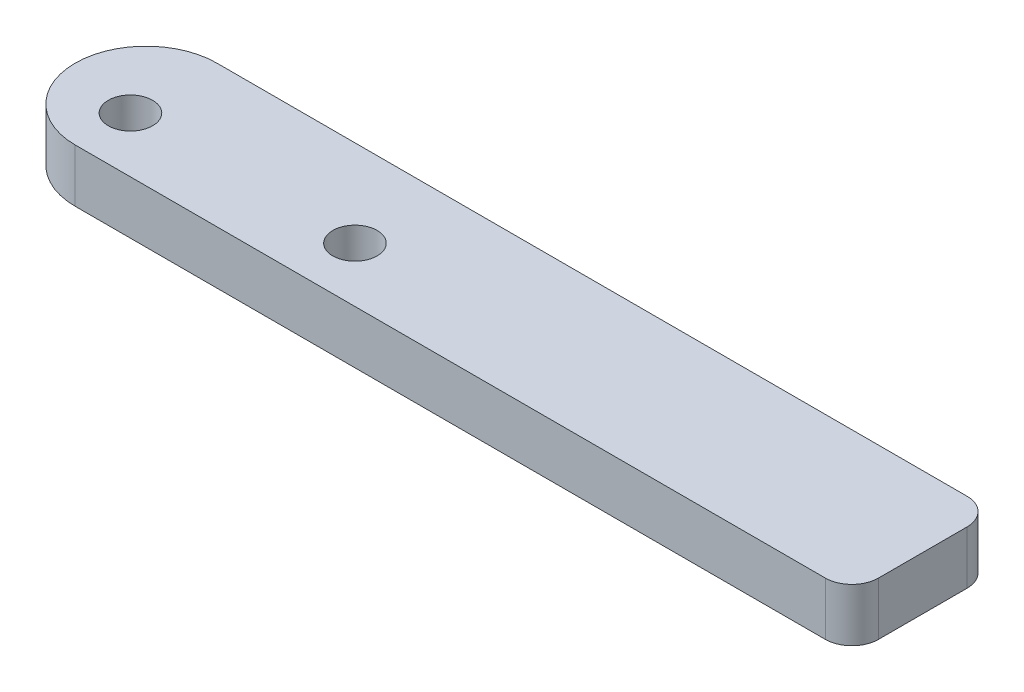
ISO-10303-21;
HEADER;
FILE_DESCRIPTION(('STEP AP214'),'2;1');
FILE_NAME('part.step','',(''),(''),'','','');
FILE_SCHEMA(('AUTOMOTIVE_DESIGN { 1 0 10303 214 1 1 1 1 }'));
ENDSEC;
DATA;
#1=APPLICATION_CONTEXT('core data for automotive mechanical design processes');
#2=APPLICATION_PROTOCOL_DEFINITION('international standard','automotive_design',2000,#1);
#3=PRODUCT_CONTEXT('',#1,'mechanical');
#4=PRODUCT('Part','Part','',(#3));
#5=PRODUCT_RELATED_PRODUCT_CATEGORY('part','',(#4));
#6=PRODUCT_DEFINITION_FORMATION('','',#4);
#7=PRODUCT_DEFINITION_CONTEXT('part definition',#1,'design');
#8=PRODUCT_DEFINITION('design','',#6,#7);
#9=PRODUCT_DEFINITION_SHAPE('','',#8);
#10=(LENGTH_UNIT() NAMED_UNIT(*) SI_UNIT(.MILLI.,.METRE.));
#11=(NAMED_UNIT(*) PLANE_ANGLE_UNIT() SI_UNIT($,.RADIAN.));
#12=(NAMED_UNIT(*) SI_UNIT($,.STERADIAN.) SOLID_ANGLE_UNIT());
#13=UNCERTAINTY_MEASURE_WITH_UNIT(LENGTH_MEASURE(1.E-05),#10,'distance_accuracy_value','');
#14=(GEOMETRIC_REPRESENTATION_CONTEXT(3) GLOBAL_UNCERTAINTY_ASSIGNED_CONTEXT((#13)) GLOBAL_UNIT_ASSIGNED_CONTEXT((#10,
#11,#12)) REPRESENTATION_CONTEXT('',''));
#15=CARTESIAN_POINT('',(0.,0.,0.));
#16=DIRECTION('',(0.,0.,1.));
#17=DIRECTION('',(1.,0.,0.));
#18=AXIS2_PLACEMENT_3D('',#15,#16,#17);
#19=CARTESIAN_POINT('',(0.,-3.00000000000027,-1.76));
#20=DIRECTION('',(0.,1.,0.));
#21=DIRECTION('',(-1.,0.,0.));
#22=AXIS2_PLACEMENT_3D('',#19,#20,#21);
#23=CYLINDRICAL_SURFACE('',#22,8.);
#24=DIRECTION('',(0.,1.,0.));
#25=VECTOR('',#24,1.);
#26=CARTESIAN_POINT('',(0.,-3.00000000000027,6.24));
#27=LINE('',#26,#25);
#28=CARTESIAN_POINT('',(0.,-3.00000000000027,6.24));
#29=VERTEX_POINT('',#28);
#30=CARTESIAN_POINT('',(0.,2.99999999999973,6.24));
#31=VERTEX_POINT('',#30);
#32=EDGE_CURVE('E140',#29,#31,#27,.T.);
#33=ORIENTED_EDGE('',*,*,#32,.T.);
#34=CARTESIAN_POINT('',(0.,2.99999999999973,-1.76));
#35=DIRECTION('',(0.,-1.,0.));
#36=DIRECTION('',(1.,0.,0.));
#37=AXIS2_PLACEMENT_3D('',#34,#35,#36);
#38=CIRCLE('',#37,8.);
#39=CARTESIAN_POINT('',(0.,2.99999999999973,-9.76));
#40=VERTEX_POINT('',#39);
#41=EDGE_CURVE('E9',#31,#40,#38,.T.);
#42=ORIENTED_EDGE('',*,*,#41,.T.);
#43=DIRECTION('',(0.,1.,0.));
#44=VECTOR('',#43,1.);
#45=CARTESIAN_POINT('',(0.,-3.00000000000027,-9.76));
#46=LINE('',#45,#44);
#47=CARTESIAN_POINT('',(0.,-3.00000000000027,-9.76));
#48=VERTEX_POINT('',#47);
#49=EDGE_CURVE('E39',#48,#40,#46,.T.);
#50=ORIENTED_EDGE('',*,*,#49,.F.);
#51=CARTESIAN_POINT('',(0.,-3.00000000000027,-1.76));
#52=DIRECTION('',(0.,-1.,0.));
#53=DIRECTION('',(1.,0.,0.));
#54=AXIS2_PLACEMENT_3D('',#51,#52,#53);
#55=CIRCLE('',#54,8.);
#56=EDGE_CURVE('E133',#29,#48,#55,.T.);
#57=ORIENTED_EDGE('',*,*,#56,.F.);
#58=EDGE_LOOP('',(#33,#42,#50,#57));
#59=FACE_BOUND('',#58,.T.);
#60=ADVANCED_FACE('F14',(#59),#23,.T.);
#61=CARTESIAN_POINT('',(0.,-3.00000000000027,6.24));
#62=DIRECTION('',(0.,0.,-1.));
#63=DIRECTION('',(0.,1.,0.));
#64=AXIS2_PLACEMENT_3D('',#61,#62,#63);
#65=PLANE('',#64);
#66=DIRECTION('',(-1.,0.,0.));
#67=VECTOR('',#66,1.);
#68=CARTESIAN_POINT('',(0.,-3.00000000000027,6.24));
#69=LINE('',#68,#67);
#70=CARTESIAN_POINT('',(84.69,-3.00000000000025,6.24));
#71=VERTEX_POINT('',#70);
#72=EDGE_CURVE('E110',#71,#29,#69,.T.);
#73=ORIENTED_EDGE('',*,*,#72,.F.);
#74=DIRECTION('',(0.,1.,0.));
#75=VECTOR('',#74,1.);
#76=CARTESIAN_POINT('',(84.69,-3.00000000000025,6.24));
#77=LINE('',#76,#75);
#78=CARTESIAN_POINT('',(84.69,2.99999999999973,6.24));
#79=VERTEX_POINT('',#78);
#80=EDGE_CURVE('E105',#71,#79,#77,.T.);
#81=ORIENTED_EDGE('',*,*,#80,.T.);
#82=DIRECTION('',(-1.,0.,0.));
#83=VECTOR('',#82,1.);
#84=CARTESIAN_POINT('',(0.,2.99999999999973,6.24));
#85=LINE('',#84,#83);
#86=EDGE_CURVE('E83',#79,#31,#85,.T.);
#87=ORIENTED_EDGE('',*,*,#86,.T.);
#88=ORIENTED_EDGE('',*,*,#32,.F.);
#89=EDGE_LOOP('',(#73,#81,#87,#88));
#90=FACE_BOUND('',#89,.T.);
#91=ADVANCED_FACE('F16',(#90),#65,.F.);
#92=CARTESIAN_POINT('',(84.69,-3.00000000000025,3.24));
#93=DIRECTION('',(0.,1.,0.));
#94=DIRECTION('',(-1.,0.,0.));
#95=AXIS2_PLACEMENT_3D('',#92,#93,#94);
#96=CYLINDRICAL_SURFACE('',#95,3.);
#97=CARTESIAN_POINT('',(84.69,-3.00000000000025,3.24));
#98=DIRECTION('',(0.,-1.,0.));
#99=DIRECTION('',(1.,0.,0.));
#100=AXIS2_PLACEMENT_3D('',#97,#98,#99);
#101=CIRCLE('',#100,3.);
#102=CARTESIAN_POINT('',(87.69,-3.00000000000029,3.24));
#103=VERTEX_POINT('',#102);
#104=EDGE_CURVE('E100',#103,#71,#101,.T.);
#105=ORIENTED_EDGE('',*,*,#104,.F.);
#106=DIRECTION('',(0.,-1.,0.));
#107=VECTOR('',#106,1.);
#108=CARTESIAN_POINT('',(87.69,-3.00000000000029,3.24));
#109=LINE('',#108,#107);
#110=CARTESIAN_POINT('',(87.69,2.99999999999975,3.24));
#111=VERTEX_POINT('',#110);
#112=EDGE_CURVE('E103',#111,#103,#109,.T.);
#113=ORIENTED_EDGE('',*,*,#112,.F.);
#114=CARTESIAN_POINT('',(84.69,2.99999999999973,3.24));
#115=DIRECTION('',(0.,1.,0.));
#116=DIRECTION('',(1.,0.,0.));
#117=AXIS2_PLACEMENT_3D('',#114,#115,#116);
#118=CIRCLE('',#117,3.);
#119=EDGE_CURVE('E141',#79,#111,#118,.T.);
#120=ORIENTED_EDGE('',*,*,#119,.F.);
#121=ORIENTED_EDGE('',*,*,#80,.F.);
#122=EDGE_LOOP('',(#105,#113,#120,#121));
#123=FACE_BOUND('',#122,.T.);
#124=ADVANCED_FACE('F102',(#123),#96,.T.);
#125=CARTESIAN_POINT('',(87.69,-3.00000000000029,6.24));
#126=DIRECTION('',(-1.,0.,0.));
#127=DIRECTION('',(0.,0.,1.));
#128=AXIS2_PLACEMENT_3D('',#125,#126,#127);
#129=PLANE('',#128);
#130=DIRECTION('',(0.,0.,1.));
#131=VECTOR('',#130,1.);
#132=CARTESIAN_POINT('',(87.69,-3.00000000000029,6.24));
#133=LINE('',#132,#131);
#134=CARTESIAN_POINT('',(87.69,-3.00000000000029,-6.76));
#135=VERTEX_POINT('',#134);
#136=EDGE_CURVE('E109',#135,#103,#133,.T.);
#137=ORIENTED_EDGE('',*,*,#136,.F.);
#138=DIRECTION('',(0.,1.,0.));
#139=VECTOR('',#138,1.);
#140=CARTESIAN_POINT('',(87.69,-3.00000000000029,-6.76));
#141=LINE('',#140,#139);
#142=CARTESIAN_POINT('',(87.69,2.99999999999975,-6.76));
#143=VERTEX_POINT('',#142);
#144=EDGE_CURVE('E126',#135,#143,#141,.T.);
#145=ORIENTED_EDGE('',*,*,#144,.T.);
#146=DIRECTION('',(0.,0.,1.));
#147=VECTOR('',#146,1.);
#148=CARTESIAN_POINT('',(87.69,2.99999999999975,6.24));
#149=LINE('',#148,#147);
#150=EDGE_CURVE('E18',#143,#111,#149,.T.);
#151=ORIENTED_EDGE('',*,*,#150,.T.);
#152=ORIENTED_EDGE('',*,*,#112,.T.);
#153=EDGE_LOOP('',(#137,#145,#151,#152));
#154=FACE_BOUND('',#153,.T.);
#155=ADVANCED_FACE('F120',(#154),#129,.F.);
#156=CARTESIAN_POINT('',(84.69,-3.00000000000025,-6.76));
#157=DIRECTION('',(0.,1.,0.));
#158=DIRECTION('',(-1.,0.,0.));
#159=AXIS2_PLACEMENT_3D('',#156,#157,#158);
#160=CYLINDRICAL_SURFACE('',#159,3.);
#161=CARTESIAN_POINT('',(84.69,-3.00000000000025,-6.76));
#162=DIRECTION('',(0.,-1.,0.));
#163=DIRECTION('',(1.,0.,0.));
#164=AXIS2_PLACEMENT_3D('',#161,#162,#163);
#165=CIRCLE('',#164,3.);
#166=CARTESIAN_POINT('',(84.69,-3.00000000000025,-9.76));
#167=VERTEX_POINT('',#166);
#168=EDGE_CURVE('E116',#167,#135,#165,.T.);
#169=ORIENTED_EDGE('',*,*,#168,.F.);
#170=DIRECTION('',(0.,-1.,0.));
#171=VECTOR('',#170,1.);
#172=CARTESIAN_POINT('',(84.69,-3.00000000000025,-9.76));
#173=LINE('',#172,#171);
#174=CARTESIAN_POINT('',(84.69,2.99999999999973,-9.76));
#175=VERTEX_POINT('',#174);
#176=EDGE_CURVE('E135',#175,#167,#173,.T.);
#177=ORIENTED_EDGE('',*,*,#176,.F.);
#178=CARTESIAN_POINT('',(84.69,2.99999999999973,-6.76));
#179=DIRECTION('',(0.,1.,0.));
#180=DIRECTION('',(1.,0.,0.));
#181=AXIS2_PLACEMENT_3D('',#178,#179,#180);
#182=CIRCLE('',#181,3.);
#183=EDGE_CURVE('E144',#143,#175,#182,.T.);
#184=ORIENTED_EDGE('',*,*,#183,.F.);
#185=ORIENTED_EDGE('',*,*,#144,.F.);
#186=EDGE_LOOP('',(#169,#177,#184,#185));
#187=FACE_BOUND('',#186,.T.);
#188=ADVANCED_FACE('F193',(#187),#160,.T.);
#189=CARTESIAN_POINT('',(0.,-3.00000000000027,-9.76));
#190=DIRECTION('',(0.,0.,1.));
#191=DIRECTION('',(1.,0.,0.));
#192=AXIS2_PLACEMENT_3D('',#189,#190,#191);
#193=PLANE('',#192);
#194=DIRECTION('',(1.,0.,0.));
#195=VECTOR('',#194,1.);
#196=CARTESIAN_POINT('',(0.,2.99999999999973,-9.76));
#197=LINE('',#196,#195);
#198=EDGE_CURVE('E91',#40,#175,#197,.T.);
#199=ORIENTED_EDGE('',*,*,#198,.T.);
#200=ORIENTED_EDGE('',*,*,#176,.T.);
#201=DIRECTION('',(1.,0.,0.));
#202=VECTOR('',#201,1.);
#203=CARTESIAN_POINT('',(0.,-3.00000000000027,-9.76));
#204=LINE('',#203,#202);
#205=EDGE_CURVE('E25',#48,#167,#204,.T.);
#206=ORIENTED_EDGE('',*,*,#205,.F.);
#207=ORIENTED_EDGE('',*,*,#49,.T.);
#208=EDGE_LOOP('',(#199,#200,#206,#207));
#209=FACE_BOUND('',#208,.T.);
#210=ADVANCED_FACE('F182',(#209),#193,.F.);
#211=CARTESIAN_POINT('',(0.,-3.00000000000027,-1.76));
#212=DIRECTION('',(0.,-1.,0.));
#213=DIRECTION('',(1.,0.,0.));
#214=AXIS2_PLACEMENT_3D('',#211,#212,#213);
#215=PLANE('',#214);
#216=ORIENTED_EDGE('',*,*,#205,.T.);
#217=ORIENTED_EDGE('',*,*,#168,.T.);
#218=ORIENTED_EDGE('',*,*,#136,.T.);
#219=ORIENTED_EDGE('',*,*,#104,.T.);
#220=ORIENTED_EDGE('',*,*,#72,.T.);
#221=ORIENTED_EDGE('',*,*,#56,.T.);
#222=EDGE_LOOP('',(#216,#217,#218,#219,#220,#221));
#223=FACE_BOUND('',#222,.T.);
#224=CARTESIAN_POINT('',(25.4,-3.00000000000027,0.0500000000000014));
#225=DIRECTION('',(0.,-1.,0.));
#226=DIRECTION('',(1.,0.,0.));
#227=AXIS2_PLACEMENT_3D('',#224,#225,#226);
#228=CIRCLE('',#227,2.5);
#229=CARTESIAN_POINT('',(27.9,-3.00000000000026,0.0500000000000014));
#230=VERTEX_POINT('',#229);
#231=EDGE_CURVE('E129',#230,#230,#228,.F.);
#232=ORIENTED_EDGE('',*,*,#231,.T.);
#233=EDGE_LOOP('',(#232));
#234=FACE_BOUND('',#233,.T.);
#235=CARTESIAN_POINT('',(0.,-3.00000000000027,0.));
#236=DIRECTION('',(0.,-1.,0.));
#237=DIRECTION('',(1.,0.,0.));
#238=AXIS2_PLACEMENT_3D('',#235,#236,#237);
#239=CIRCLE('',#238,2.5);
#240=CARTESIAN_POINT('',(2.49999999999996,-3.00000000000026,0.));
#241=VERTEX_POINT('',#240);
#242=EDGE_CURVE('E299',#241,#241,#239,.F.);
#243=ORIENTED_EDGE('',*,*,#242,.T.);
#244=EDGE_LOOP('',(#243));
#245=FACE_BOUND('',#244,.T.);
#246=ADVANCED_FACE('F114',(#223,#234,#245),#215,.T.);
#247=CARTESIAN_POINT('',(25.4,3.00440734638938,0.0500000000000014));
#248=DIRECTION('',(0.,-1.,0.));
#249=DIRECTION('',(1.,0.,0.));
#250=AXIS2_PLACEMENT_3D('',#247,#248,#249);
#251=CYLINDRICAL_SURFACE('',#250,2.5);
#252=ORIENTED_EDGE('',*,*,#231,.F.);
#253=EDGE_LOOP('',(#252));
#254=FACE_BOUND('',#253,.T.);
#255=CARTESIAN_POINT('',(25.4,2.99999999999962,0.0500000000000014));
#256=DIRECTION('',(0.,1.,0.));
#257=DIRECTION('',(-1.,0.,0.));
#258=AXIS2_PLACEMENT_3D('',#255,#256,#257);
#259=CIRCLE('',#258,2.5);
#260=CARTESIAN_POINT('',(22.9,2.99999999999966,0.0500000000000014));
#261=VERTEX_POINT('',#260);
#262=EDGE_CURVE('E301',#261,#261,#259,.T.);
#263=ORIENTED_EDGE('',*,*,#262,.T.);
#264=EDGE_LOOP('',(#263));
#265=FACE_BOUND('',#264,.T.);
#266=ADVANCED_FACE('F181',(#254,#265),#251,.F.);
#267=CARTESIAN_POINT('',(0.,2.99999999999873,0.));
#268=DIRECTION('',(0.,-1.,0.));
#269=DIRECTION('',(0.923728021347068,0.,-0.383049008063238));
#270=AXIS2_PLACEMENT_3D('',#267,#268,#269);
#271=PLANE('',#270);
#272=CARTESIAN_POINT('',(0.,3.,0.));
#273=DIRECTION('',(0.,1.,0.));
#274=DIRECTION('',(-1.,0.,0.));
#275=AXIS2_PLACEMENT_3D('',#272,#273,#274);
#276=CIRCLE('',#275,2.5);
#277=CARTESIAN_POINT('',(-2.49999999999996,3.00000000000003,0.));
#278=VERTEX_POINT('',#277);
#279=EDGE_CURVE('E296',#278,#278,#276,.T.);
#280=ORIENTED_EDGE('',*,*,#279,.F.);
#281=EDGE_LOOP('',(#280));
#282=FACE_BOUND('',#281,.T.);
#283=ORIENTED_EDGE('',*,*,#150,.F.);
#284=ORIENTED_EDGE('',*,*,#183,.T.);
#285=ORIENTED_EDGE('',*,*,#198,.F.);
#286=ORIENTED_EDGE('',*,*,#41,.F.);
#287=ORIENTED_EDGE('',*,*,#86,.F.);
#288=ORIENTED_EDGE('',*,*,#119,.T.);
#289=EDGE_LOOP('',(#283,#284,#285,#286,#287,#288));
#290=FACE_BOUND('',#289,.T.);
#291=ORIENTED_EDGE('',*,*,#262,.F.);
#292=EDGE_LOOP('',(#291));
#293=FACE_BOUND('',#292,.T.);
#294=ADVANCED_FACE('F235',(#282,#290,#293),#271,.F.);
#295=CARTESIAN_POINT('',(0.,-2.99600000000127,0.));
#296=DIRECTION('',(0.,1.,0.));
#297=DIRECTION('',(-0.923728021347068,0.,0.383049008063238));
#298=AXIS2_PLACEMENT_3D('',#295,#296,#297);
#299=CYLINDRICAL_SURFACE('',#298,2.5);
#300=ORIENTED_EDGE('',*,*,#279,.T.);
#301=EDGE_LOOP('',(#300));
#302=FACE_BOUND('',#301,.T.);
#303=ORIENTED_EDGE('',*,*,#242,.F.);
#304=EDGE_LOOP('',(#303));
#305=FACE_BOUND('',#304,.T.);
#306=ADVANCED_FACE('F244',(#302,#305),#299,.F.);
#307=CLOSED_SHELL('',(#60,#91,#124,#155,#188,#210,#246,#266,#294,#306));
#308=MANIFOLD_SOLID_BREP('B1',#307);
#309=ADVANCED_BREP_SHAPE_REPRESENTATION('',(#18,#308),#14);
#310=SHAPE_DEFINITION_REPRESENTATION(#9,#309);
ENDSEC;
END-ISO-10303-21;
